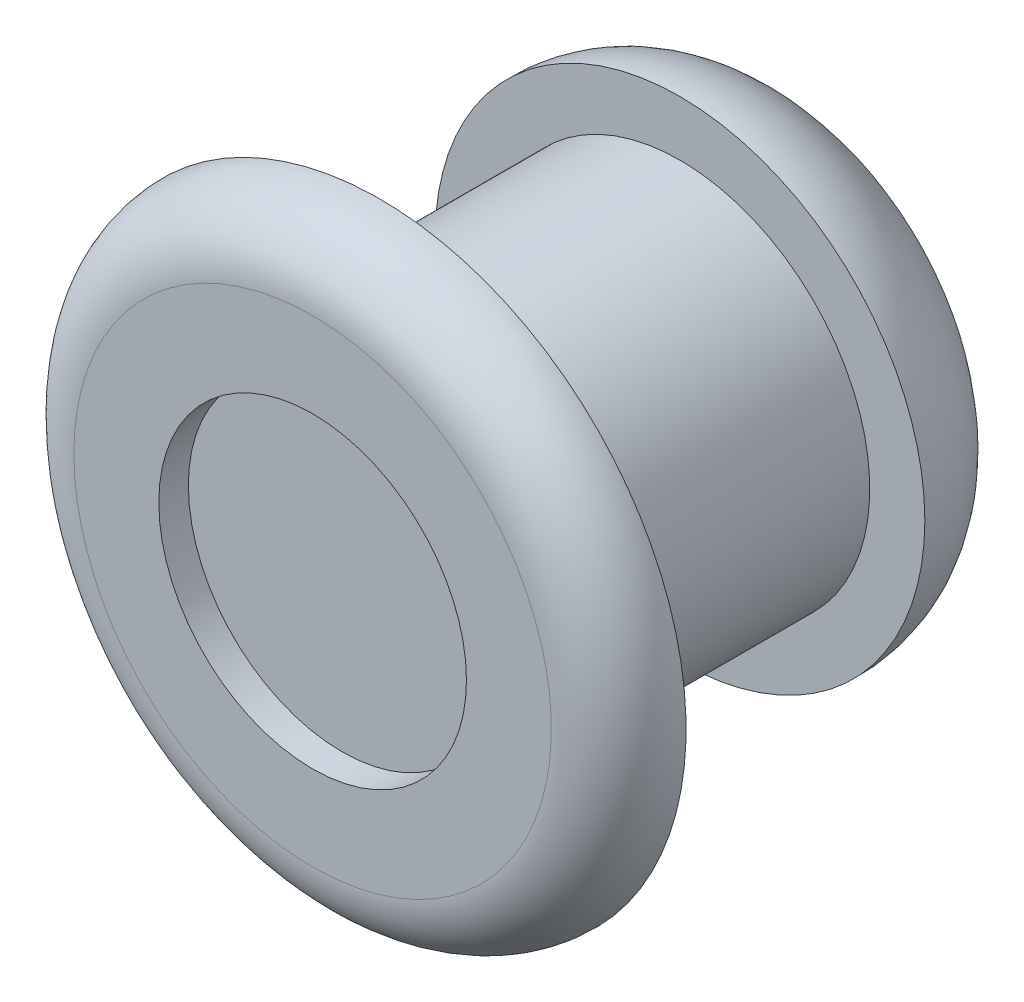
ISO-10303-21;
HEADER;
FILE_DESCRIPTION(('STEP AP214'),'2;1');
FILE_NAME('part.step','',(''),(''),'','','');
FILE_SCHEMA(('AUTOMOTIVE_DESIGN { 1 0 10303 214 1 1 1 1 }'));
ENDSEC;
DATA;
#1=APPLICATION_CONTEXT('core data for automotive mechanical design processes');
#2=APPLICATION_PROTOCOL_DEFINITION('international standard','automotive_design',2000,#1);
#3=PRODUCT_CONTEXT('',#1,'mechanical');
#4=PRODUCT('Part','Part','',(#3));
#5=PRODUCT_RELATED_PRODUCT_CATEGORY('part','',(#4));
#6=PRODUCT_DEFINITION_FORMATION('','',#4);
#7=PRODUCT_DEFINITION_CONTEXT('part definition',#1,'design');
#8=PRODUCT_DEFINITION('design','',#6,#7);
#9=PRODUCT_DEFINITION_SHAPE('','',#8);
#10=(LENGTH_UNIT() NAMED_UNIT(*) SI_UNIT(.MILLI.,.METRE.));
#11=(NAMED_UNIT(*) PLANE_ANGLE_UNIT() SI_UNIT($,.RADIAN.));
#12=(NAMED_UNIT(*) SI_UNIT($,.STERADIAN.) SOLID_ANGLE_UNIT());
#13=UNCERTAINTY_MEASURE_WITH_UNIT(LENGTH_MEASURE(1.E-05),#10,'distance_accuracy_value','');
#14=(GEOMETRIC_REPRESENTATION_CONTEXT(3) GLOBAL_UNCERTAINTY_ASSIGNED_CONTEXT((#13)) GLOBAL_UNIT_ASSIGNED_CONTEXT((#10,
#11,#12)) REPRESENTATION_CONTEXT('',''));
#15=CARTESIAN_POINT('',(0.,0.,0.));
#16=DIRECTION('',(0.,0.,1.));
#17=DIRECTION('',(1.,0.,0.));
#18=AXIS2_PLACEMENT_3D('',#15,#16,#17);
#19=CARTESIAN_POINT('',(44.0000696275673,-41.3602346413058,-4.9));
#20=DIRECTION('',(0.,0.,1.));
#21=DIRECTION('',(1.,0.,0.));
#22=AXIS2_PLACEMENT_3D('',#19,#20,#21);
#23=PLANE('',#22);
#24=CARTESIAN_POINT('',(44.0000696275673,-44.4602346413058,-4.9));
#25=DIRECTION('',(0.,0.,-1.));
#26=DIRECTION('',(-1.,0.,0.));
#27=AXIS2_PLACEMENT_3D('',#24,#25,#26);
#28=CIRCLE('',#27,3.1);
#29=CARTESIAN_POINT('',(40.9000696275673,-44.4602346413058,-4.9));
#30=VERTEX_POINT('',#29);
#31=EDGE_CURVE('E60',#30,#30,#28,.T.);
#32=ORIENTED_EDGE('',*,*,#31,.T.);
#33=EDGE_LOOP('',(#32));
#34=FACE_BOUND('',#33,.T.);
#35=CARTESIAN_POINT('',(44.0000696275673,-44.4602346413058,-4.9));
#36=DIRECTION('',(0.,0.,-1.));
#37=DIRECTION('',(-1.,0.,0.));
#38=AXIS2_PLACEMENT_3D('',#35,#36,#37);
#39=CIRCLE('',#38,4.);
#40=CARTESIAN_POINT('',(40.0000696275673,-44.4602346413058,-4.9));
#41=VERTEX_POINT('',#40);
#42=EDGE_CURVE('E10',#41,#41,#39,.T.);
#43=ORIENTED_EDGE('',*,*,#42,.F.);
#44=EDGE_LOOP('',(#43));
#45=FACE_BOUND('',#44,.T.);
#46=ADVANCED_FACE('F26',(#34,#45),#23,.T.);
#47=CARTESIAN_POINT('',(44.0000696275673,-44.4602346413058,-4.96566670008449));
#48=DIRECTION('',(0.,0.,-1.));
#49=DIRECTION('',(-1.,0.,0.));
#50=AXIS2_PLACEMENT_3D('',#47,#48,#49);
#51=TOROIDAL_SURFACE('',#50,2.06566670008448,1.93544760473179);
#52=ORIENTED_EDGE('',*,*,#42,.T.);
#53=EDGE_LOOP('',(#52));
#54=FACE_BOUND('',#53,.T.);
#55=CARTESIAN_POINT('',(44.0000696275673,-44.4602346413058,-6.9));
#56=DIRECTION('',(0.,0.,-1.));
#57=DIRECTION('',(-1.,0.,0.));
#58=AXIS2_PLACEMENT_3D('',#55,#56,#57);
#59=CIRCLE('',#58,2.13133340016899);
#60=CARTESIAN_POINT('',(41.8687362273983,-44.4602346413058,-6.9));
#61=VERTEX_POINT('',#60);
#62=EDGE_CURVE('E32',#61,#61,#59,.T.);
#63=ORIENTED_EDGE('',*,*,#62,.F.);
#64=EDGE_LOOP('',(#63));
#65=FACE_BOUND('',#64,.T.);
#66=ADVANCED_FACE('F78',(#54,#65),#51,.T.);
#67=CARTESIAN_POINT('',(44.0000696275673,-42.7102346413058,-6.9));
#68=DIRECTION('',(0.,0.,-1.));
#69=DIRECTION('',(-1.,0.,0.));
#70=AXIS2_PLACEMENT_3D('',#67,#68,#69);
#71=PLANE('',#70);
#72=ORIENTED_EDGE('',*,*,#62,.T.);
#73=EDGE_LOOP('',(#72));
#74=FACE_BOUND('',#73,.T.);
#75=CARTESIAN_POINT('',(44.0000696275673,-44.4602346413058,-6.9));
#76=DIRECTION('',(0.,0.,-1.));
#77=DIRECTION('',(-1.,0.,0.));
#78=AXIS2_PLACEMENT_3D('',#75,#76,#77);
#79=CIRCLE('',#78,1.75);
#80=CARTESIAN_POINT('',(42.2500696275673,-44.4602346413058,-6.9));
#81=VERTEX_POINT('',#80);
#82=EDGE_CURVE('E36',#81,#81,#79,.T.);
#83=ORIENTED_EDGE('',*,*,#82,.F.);
#84=EDGE_LOOP('',(#83));
#85=FACE_BOUND('',#84,.T.);
#86=ADVANCED_FACE('F82',(#74,#85),#71,.T.);
#87=CARTESIAN_POINT('',(44.0000696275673,-44.4602346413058,-4.9));
#88=DIRECTION('',(0.,0.,-1.));
#89=DIRECTION('',(-1.,0.,0.));
#90=AXIS2_PLACEMENT_3D('',#87,#88,#89);
#91=CYLINDRICAL_SURFACE('',#90,1.75);
#92=ORIENTED_EDGE('',*,*,#82,.T.);
#93=EDGE_LOOP('',(#92));
#94=FACE_BOUND('',#93,.T.);
#95=CARTESIAN_POINT('',(44.0000696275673,-44.4602346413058,-0.959207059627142));
#96=DIRECTION('',(0.,0.,-1.));
#97=DIRECTION('',(-1.,0.,0.));
#98=AXIS2_PLACEMENT_3D('',#95,#96,#97);
#99=CIRCLE('',#98,1.75);
#100=CARTESIAN_POINT('',(42.2500696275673,-44.4602346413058,-0.959207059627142));
#101=VERTEX_POINT('',#100);
#102=EDGE_CURVE('E40',#101,#101,#99,.T.);
#103=ORIENTED_EDGE('',*,*,#102,.F.);
#104=EDGE_LOOP('',(#103));
#105=FACE_BOUND('',#104,.T.);
#106=ADVANCED_FACE('F86',(#94,#105),#91,.F.);
#107=CARTESIAN_POINT('',(44.0000696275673,-42.7102346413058,-0.959207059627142));
#108=DIRECTION('',(0.,0.,-1.));
#109=DIRECTION('',(-1.,0.,0.));
#110=AXIS2_PLACEMENT_3D('',#107,#108,#109);
#111=PLANE('',#110);
#112=ORIENTED_EDGE('',*,*,#102,.T.);
#113=EDGE_LOOP('',(#112));
#114=FACE_BOUND('',#113,.T.);
#115=ADVANCED_FACE('F92',(#114),#111,.T.);
#116=CARTESIAN_POINT('',(44.0000696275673,-42.7102346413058,0.617184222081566));
#117=DIRECTION('',(0.,0.,1.));
#118=DIRECTION('',(1.,0.,0.));
#119=AXIS2_PLACEMENT_3D('',#116,#117,#118);
#120=PLANE('',#119);
#121=CARTESIAN_POINT('',(44.0000696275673,-44.4602346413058,0.617184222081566));
#122=DIRECTION('',(0.,0.,-1.));
#123=DIRECTION('',(-1.,0.,0.));
#124=AXIS2_PLACEMENT_3D('',#121,#122,#123);
#125=CIRCLE('',#124,2.51266680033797);
#126=CARTESIAN_POINT('',(41.4874028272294,-44.4602346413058,0.617184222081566));
#127=VERTEX_POINT('',#126);
#128=EDGE_CURVE('E45',#127,#127,#125,.T.);
#129=ORIENTED_EDGE('',*,*,#128,.F.);
#130=EDGE_LOOP('',(#129));
#131=FACE_BOUND('',#130,.T.);
#132=ADVANCED_FACE('F96',(#131),#120,.T.);
#133=CARTESIAN_POINT('',(44.0000696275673,-44.4602346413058,-4.9));
#134=DIRECTION('',(0.,0.,-1.));
#135=DIRECTION('',(-1.,0.,0.));
#136=AXIS2_PLACEMENT_3D('',#133,#134,#135);
#137=CYLINDRICAL_SURFACE('',#136,2.51266680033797);
#138=ORIENTED_EDGE('',*,*,#128,.T.);
#139=EDGE_LOOP('',(#138));
#140=FACE_BOUND('',#139,.T.);
#141=CARTESIAN_POINT('',(44.0000696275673,-44.4602346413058,1.1));
#142=DIRECTION('',(0.,0.,-1.));
#143=DIRECTION('',(-1.,0.,0.));
#144=AXIS2_PLACEMENT_3D('',#141,#142,#143);
#145=CIRCLE('',#144,2.51266680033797);
#146=CARTESIAN_POINT('',(41.4874028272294,-44.4602346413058,1.1));
#147=VERTEX_POINT('',#146);
#148=EDGE_CURVE('E48',#147,#147,#145,.T.);
#149=ORIENTED_EDGE('',*,*,#148,.F.);
#150=EDGE_LOOP('',(#149));
#151=FACE_BOUND('',#150,.T.);
#152=ADVANCED_FACE('F100',(#140,#151),#137,.F.);
#153=CARTESIAN_POINT('',(44.0000696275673,-41.9475678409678,1.1));
#154=DIRECTION('',(0.,0.,1.));
#155=DIRECTION('',(1.,0.,0.));
#156=AXIS2_PLACEMENT_3D('',#153,#154,#155);
#157=PLANE('',#156);
#158=ORIENTED_EDGE('',*,*,#148,.T.);
#159=EDGE_LOOP('',(#158));
#160=FACE_BOUND('',#159,.T.);
#161=CARTESIAN_POINT('',(44.0000696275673,-44.4602346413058,1.09999999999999));
#162=DIRECTION('',(0.,0.,-1.));
#163=DIRECTION('',(-1.,0.,0.));
#164=AXIS2_PLACEMENT_3D('',#161,#162,#163);
#165=CIRCLE('',#164,3.90000000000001);
#166=CARTESIAN_POINT('',(40.1000696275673,-44.4602346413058,1.09999999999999));
#167=VERTEX_POINT('',#166);
#168=EDGE_CURVE('E51',#167,#167,#165,.T.);
#169=ORIENTED_EDGE('',*,*,#168,.F.);
#170=EDGE_LOOP('',(#169));
#171=FACE_BOUND('',#170,.T.);
#172=ADVANCED_FACE('F104',(#160,#171),#157,.T.);
#173=CARTESIAN_POINT('',(44.0000696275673,-44.4602346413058,0.));
#174=DIRECTION('',(0.,0.,-1.));
#175=DIRECTION('',(-1.,0.,0.));
#176=AXIS2_PLACEMENT_3D('',#173,#174,#175);
#177=TOROIDAL_SURFACE('',#176,3.90000000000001,1.09999999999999);
#178=ORIENTED_EDGE('',*,*,#168,.T.);
#179=EDGE_LOOP('',(#178));
#180=FACE_BOUND('',#179,.T.);
#181=CARTESIAN_POINT('',(44.0000696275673,-44.4602346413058,0.));
#182=DIRECTION('',(0.,0.,-1.));
#183=DIRECTION('',(-1.,0.,0.));
#184=AXIS2_PLACEMENT_3D('',#181,#182,#183);
#185=CIRCLE('',#184,4.99999999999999);
#186=CARTESIAN_POINT('',(39.0000696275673,-44.4602346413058,0.));
#187=VERTEX_POINT('',#186);
#188=EDGE_CURVE('E54',#187,#187,#185,.T.);
#189=ORIENTED_EDGE('',*,*,#188,.F.);
#190=EDGE_LOOP('',(#189));
#191=FACE_BOUND('',#190,.T.);
#192=ADVANCED_FACE('F74',(#180,#191),#177,.T.);
#193=CARTESIAN_POINT('',(44.0000696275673,-41.3602346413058,0.));
#194=DIRECTION('',(0.,0.,-1.));
#195=DIRECTION('',(-1.,0.,0.));
#196=AXIS2_PLACEMENT_3D('',#193,#194,#195);
#197=PLANE('',#196);
#198=ORIENTED_EDGE('',*,*,#188,.T.);
#199=EDGE_LOOP('',(#198));
#200=FACE_BOUND('',#199,.T.);
#201=CARTESIAN_POINT('',(44.0000696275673,-44.4602346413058,0.));
#202=DIRECTION('',(0.,0.,-1.));
#203=DIRECTION('',(-1.,0.,0.));
#204=AXIS2_PLACEMENT_3D('',#201,#202,#203);
#205=CIRCLE('',#204,3.1);
#206=CARTESIAN_POINT('',(40.9000696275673,-44.4602346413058,0.));
#207=VERTEX_POINT('',#206);
#208=EDGE_CURVE('E57',#207,#207,#205,.T.);
#209=ORIENTED_EDGE('',*,*,#208,.F.);
#210=EDGE_LOOP('',(#209));
#211=FACE_BOUND('',#210,.T.);
#212=ADVANCED_FACE('F68',(#200,#211),#197,.T.);
#213=CARTESIAN_POINT('',(44.0000696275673,-44.4602346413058,-4.9));
#214=DIRECTION('',(0.,0.,-1.));
#215=DIRECTION('',(-1.,0.,0.));
#216=AXIS2_PLACEMENT_3D('',#213,#214,#215);
#217=CYLINDRICAL_SURFACE('',#216,3.1);
#218=ORIENTED_EDGE('',*,*,#208,.T.);
#219=EDGE_LOOP('',(#218));
#220=FACE_BOUND('',#219,.T.);
#221=ORIENTED_EDGE('',*,*,#31,.F.);
#222=EDGE_LOOP('',(#221));
#223=FACE_BOUND('',#222,.T.);
#224=ADVANCED_FACE('F66',(#220,#223),#217,.T.);
#225=CLOSED_SHELL('',(#46,#66,#86,#106,#115,#132,#152,#172,#192,#212,#224));
#226=MANIFOLD_SOLID_BREP('B2',#225);
#227=ADVANCED_BREP_SHAPE_REPRESENTATION('',(#18,#226),#14);
#228=SHAPE_DEFINITION_REPRESENTATION(#9,#227);
ENDSEC;
END-ISO-10303-21;
